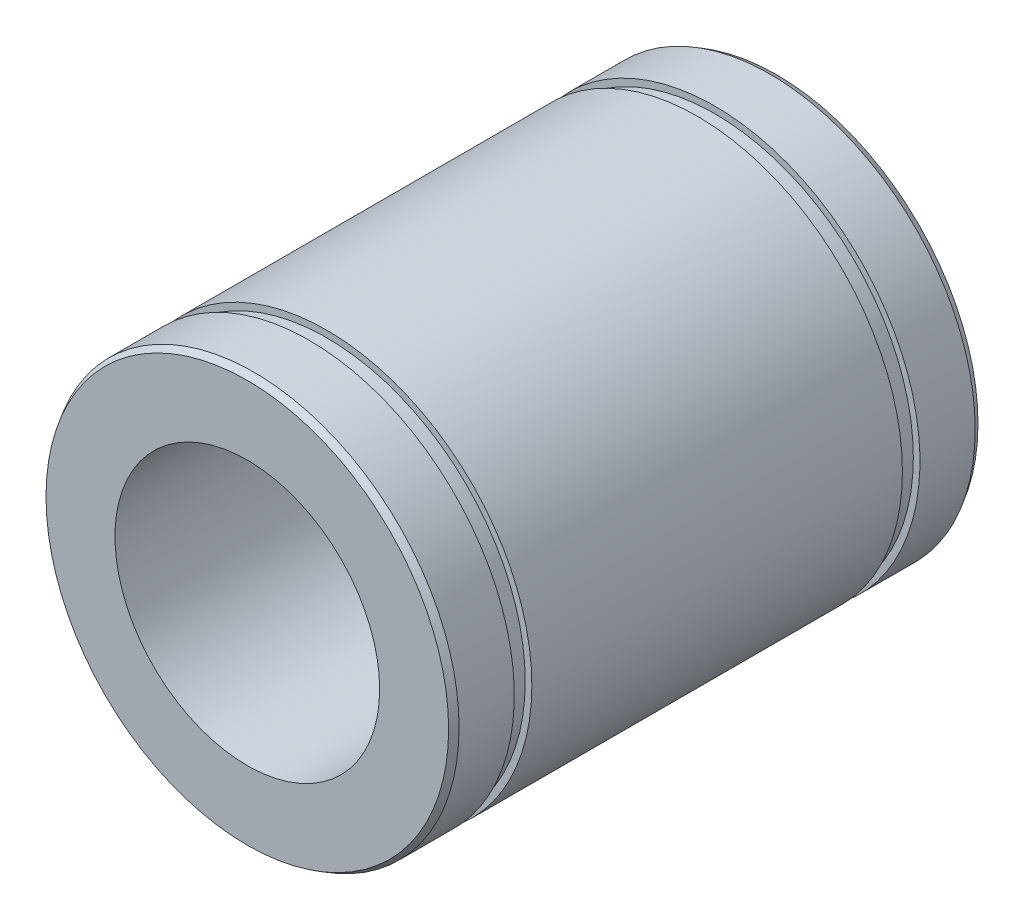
ISO-10303-21;
HEADER;
FILE_DESCRIPTION(('STEP AP214'),'2;1');
FILE_NAME('part.step','',(''),(''),'','','');
FILE_SCHEMA(('AUTOMOTIVE_DESIGN { 1 0 10303 214 1 1 1 1 }'));
ENDSEC;
DATA;
#1=APPLICATION_CONTEXT('core data for automotive mechanical design processes');
#2=APPLICATION_PROTOCOL_DEFINITION('international standard','automotive_design',2000,#1);
#3=PRODUCT_CONTEXT('',#1,'mechanical');
#4=PRODUCT('Part','Part','',(#3));
#5=PRODUCT_RELATED_PRODUCT_CATEGORY('part','',(#4));
#6=PRODUCT_DEFINITION_FORMATION('','',#4);
#7=PRODUCT_DEFINITION_CONTEXT('part definition',#1,'design');
#8=PRODUCT_DEFINITION('design','',#6,#7);
#9=PRODUCT_DEFINITION_SHAPE('','',#8);
#10=(LENGTH_UNIT() NAMED_UNIT(*) SI_UNIT(.MILLI.,.METRE.));
#11=(NAMED_UNIT(*) PLANE_ANGLE_UNIT() SI_UNIT($,.RADIAN.));
#12=(NAMED_UNIT(*) SI_UNIT($,.STERADIAN.) SOLID_ANGLE_UNIT());
#13=UNCERTAINTY_MEASURE_WITH_UNIT(LENGTH_MEASURE(1.E-05),#10,'distance_accuracy_value','');
#14=(GEOMETRIC_REPRESENTATION_CONTEXT(3) GLOBAL_UNCERTAINTY_ASSIGNED_CONTEXT((#13)) GLOBAL_UNIT_ASSIGNED_CONTEXT((#10,
#11,#12)) REPRESENTATION_CONTEXT('',''));
#15=CARTESIAN_POINT('',(0.,0.,0.));
#16=DIRECTION('',(0.,0.,1.));
#17=DIRECTION('',(1.,0.,0.));
#18=AXIS2_PLACEMENT_3D('',#15,#16,#17);
#19=CARTESIAN_POINT('',(0.,0.,40.));
#20=DIRECTION('',(0.,0.,-1.));
#21=DIRECTION('',(-1.,0.,0.));
#22=AXIS2_PLACEMENT_3D('',#19,#20,#21);
#23=CYLINDRICAL_SURFACE('',#22,31.);
#24=CARTESIAN_POINT('',(0.,0.,39.));
#25=DIRECTION('',(0.,0.,1.));
#26=DIRECTION('',(1.,0.,0.));
#27=AXIS2_PLACEMENT_3D('',#24,#25,#26);
#28=CIRCLE('',#27,31.);
#29=CARTESIAN_POINT('',(31.,0.,39.));
#30=VERTEX_POINT('',#29);
#31=EDGE_CURVE('E10',#30,#30,#28,.F.);
#32=ORIENTED_EDGE('',*,*,#31,.T.);
#33=EDGE_LOOP('',(#32));
#34=FACE_BOUND('',#33,.T.);
#35=CARTESIAN_POINT('',(0.,0.,30.65));
#36=DIRECTION('',(0.,0.,-1.));
#37=DIRECTION('',(-1.,0.,0.));
#38=AXIS2_PLACEMENT_3D('',#35,#36,#37);
#39=CIRCLE('',#38,31.);
#40=CARTESIAN_POINT('',(-31.,0.,30.65));
#41=VERTEX_POINT('',#40);
#42=EDGE_CURVE('E32',#41,#41,#39,.T.);
#43=ORIENTED_EDGE('',*,*,#42,.F.);
#44=EDGE_LOOP('',(#43));
#45=FACE_BOUND('',#44,.T.);
#46=ADVANCED_FACE('F29',(#34,#45),#23,.T.);
#47=CARTESIAN_POINT('',(0.,0.,28.));
#48=DIRECTION('',(0.,0.,1.));
#49=DIRECTION('',(1.,0.,0.));
#50=AXIS2_PLACEMENT_3D('',#47,#48,#49);
#51=CIRCLE('',#50,31.);
#52=CARTESIAN_POINT('',(31.,0.,28.));
#53=VERTEX_POINT('',#52);
#54=EDGE_CURVE('E44',#53,#53,#51,.T.);
#55=ORIENTED_EDGE('',*,*,#54,.F.);
#56=EDGE_LOOP('',(#55));
#57=FACE_BOUND('',#56,.T.);
#58=CARTESIAN_POINT('',(0.,0.,-28.));
#59=DIRECTION('',(0.,0.,1.));
#60=DIRECTION('',(1.,0.,0.));
#61=AXIS2_PLACEMENT_3D('',#58,#59,#60);
#62=CIRCLE('',#61,31.);
#63=CARTESIAN_POINT('',(31.,0.,-28.));
#64=VERTEX_POINT('',#63);
#65=EDGE_CURVE('E137',#64,#64,#62,.T.);
#66=ORIENTED_EDGE('',*,*,#65,.T.);
#67=EDGE_LOOP('',(#66));
#68=FACE_BOUND('',#67,.T.);
#69=ADVANCED_FACE('F67',(#57,#68),#23,.T.);
#70=CARTESIAN_POINT('',(0.,0.,40.));
#71=DIRECTION('',(0.,0.,1.));
#72=DIRECTION('',(1.,0.,0.));
#73=AXIS2_PLACEMENT_3D('',#70,#71,#72);
#74=PLANE('',#73);
#75=CARTESIAN_POINT('',(0.,0.,40.));
#76=DIRECTION('',(0.,0.,1.));
#77=DIRECTION('',(1.,0.,0.));
#78=AXIS2_PLACEMENT_3D('',#75,#76,#77);
#79=CIRCLE('',#78,30.4226497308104);
#80=CARTESIAN_POINT('',(30.4226497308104,0.,40.));
#81=VERTEX_POINT('',#80);
#82=EDGE_CURVE('E36',#81,#81,#79,.T.);
#83=ORIENTED_EDGE('',*,*,#82,.T.);
#84=EDGE_LOOP('',(#83));
#85=FACE_BOUND('',#84,.T.);
#86=CARTESIAN_POINT('',(0.,0.,40.));
#87=DIRECTION('',(0.,0.,1.));
#88=DIRECTION('',(1.,0.,0.));
#89=AXIS2_PLACEMENT_3D('',#86,#87,#88);
#90=CIRCLE('',#89,20.);
#91=CARTESIAN_POINT('',(20.,0.,40.));
#92=VERTEX_POINT('',#91);
#93=EDGE_CURVE('E41',#92,#92,#90,.T.);
#94=ORIENTED_EDGE('',*,*,#93,.F.);
#95=EDGE_LOOP('',(#94));
#96=FACE_BOUND('',#95,.T.);
#97=ADVANCED_FACE('F65',(#85,#96),#74,.T.);
#98=CARTESIAN_POINT('',(0.,0.,40.));
#99=DIRECTION('',(0.,0.,-1.));
#100=DIRECTION('',(-1.,0.,0.));
#101=AXIS2_PLACEMENT_3D('',#98,#99,#100);
#102=CYLINDRICAL_SURFACE('',#101,20.);
#103=ORIENTED_EDGE('',*,*,#93,.T.);
#104=EDGE_LOOP('',(#103));
#105=FACE_BOUND('',#104,.T.);
#106=CARTESIAN_POINT('',(0.,0.,-40.));
#107=DIRECTION('',(0.,0.,1.));
#108=DIRECTION('',(1.,0.,0.));
#109=AXIS2_PLACEMENT_3D('',#106,#107,#108);
#110=CIRCLE('',#109,20.);
#111=CARTESIAN_POINT('',(20.,0.,-40.));
#112=VERTEX_POINT('',#111);
#113=EDGE_CURVE('E140',#112,#112,#110,.T.);
#114=ORIENTED_EDGE('',*,*,#113,.F.);
#115=EDGE_LOOP('',(#114));
#116=FACE_BOUND('',#115,.T.);
#117=ADVANCED_FACE('F62',(#105,#116),#102,.F.);
#118=CARTESIAN_POINT('',(0.,0.,40.));
#119=DIRECTION('',(0.,0.,-1.));
#120=DIRECTION('',(-1.,0.,0.));
#121=AXIS2_PLACEMENT_3D('',#118,#119,#120);
#122=CONICAL_SURFACE('',#121,30.4226497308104,0.523598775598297);
#123=ORIENTED_EDGE('',*,*,#31,.F.);
#124=EDGE_LOOP('',(#123));
#125=FACE_BOUND('',#124,.T.);
#126=ORIENTED_EDGE('',*,*,#82,.F.);
#127=EDGE_LOOP('',(#126));
#128=FACE_BOUND('',#127,.T.);
#129=ADVANCED_FACE('F75',(#125,#128),#122,.T.);
#130=CARTESIAN_POINT('',(0.,30.,30.65));
#131=DIRECTION('',(0.,0.,-1.));
#132=DIRECTION('',(-1.,0.,0.));
#133=AXIS2_PLACEMENT_3D('',#130,#131,#132);
#134=PLANE('',#133);
#135=CARTESIAN_POINT('',(0.,0.,30.65));
#136=DIRECTION('',(0.,0.,1.));
#137=DIRECTION('',(1.,0.,0.));
#138=AXIS2_PLACEMENT_3D('',#135,#136,#137);
#139=CIRCLE('',#138,30.);
#140=CARTESIAN_POINT('',(30.,0.,30.65));
#141=VERTEX_POINT('',#140);
#142=EDGE_CURVE('E51',#141,#141,#139,.T.);
#143=ORIENTED_EDGE('',*,*,#142,.T.);
#144=EDGE_LOOP('',(#143));
#145=FACE_BOUND('',#144,.T.);
#146=ORIENTED_EDGE('',*,*,#42,.T.);
#147=EDGE_LOOP('',(#146));
#148=FACE_BOUND('',#147,.T.);
#149=ADVANCED_FACE('F88',(#145,#148),#134,.T.);
#150=CARTESIAN_POINT('',(0.,30.,28.));
#151=DIRECTION('',(0.,0.,1.));
#152=DIRECTION('',(1.,0.,0.));
#153=AXIS2_PLACEMENT_3D('',#150,#151,#152);
#154=PLANE('',#153);
#155=CARTESIAN_POINT('',(0.,0.,28.));
#156=DIRECTION('',(0.,0.,1.));
#157=DIRECTION('',(1.,0.,0.));
#158=AXIS2_PLACEMENT_3D('',#155,#156,#157);
#159=CIRCLE('',#158,30.);
#160=CARTESIAN_POINT('',(30.,0.,28.));
#161=VERTEX_POINT('',#160);
#162=EDGE_CURVE('E46',#161,#161,#159,.T.);
#163=ORIENTED_EDGE('',*,*,#162,.F.);
#164=EDGE_LOOP('',(#163));
#165=FACE_BOUND('',#164,.T.);
#166=ORIENTED_EDGE('',*,*,#54,.T.);
#167=EDGE_LOOP('',(#166));
#168=FACE_BOUND('',#167,.T.);
#169=ADVANCED_FACE('F90',(#165,#168),#154,.T.);
#170=CARTESIAN_POINT('',(0.,0.,39.));
#171=DIRECTION('',(0.,0.,1.));
#172=DIRECTION('',(1.,0.,0.));
#173=AXIS2_PLACEMENT_3D('',#170,#171,#172);
#174=CYLINDRICAL_SURFACE('',#173,30.);
#175=ORIENTED_EDGE('',*,*,#162,.T.);
#176=EDGE_LOOP('',(#175));
#177=FACE_BOUND('',#176,.T.);
#178=ORIENTED_EDGE('',*,*,#142,.F.);
#179=EDGE_LOOP('',(#178));
#180=FACE_BOUND('',#179,.T.);
#181=ADVANCED_FACE('F97',(#177,#180),#174,.T.);
#182=CARTESIAN_POINT('',(0.,0.,-40.));
#183=DIRECTION('',(0.,0.,1.));
#184=DIRECTION('',(-1.,0.,0.));
#185=AXIS2_PLACEMENT_3D('',#182,#183,#184);
#186=CYLINDRICAL_SURFACE('',#185,31.);
#187=CARTESIAN_POINT('',(0.,0.,-39.));
#188=DIRECTION('',(0.,0.,1.));
#189=DIRECTION('',(1.,0.,0.));
#190=AXIS2_PLACEMENT_3D('',#187,#188,#189);
#191=CIRCLE('',#190,31.);
#192=CARTESIAN_POINT('',(31.,0.,-39.));
#193=VERTEX_POINT('',#192);
#194=EDGE_CURVE('E56',#193,#193,#191,.F.);
#195=ORIENTED_EDGE('',*,*,#194,.F.);
#196=EDGE_LOOP('',(#195));
#197=FACE_BOUND('',#196,.T.);
#198=CARTESIAN_POINT('',(0.,0.,-30.65));
#199=DIRECTION('',(0.,0.,-1.));
#200=DIRECTION('',(-1.,0.,0.));
#201=AXIS2_PLACEMENT_3D('',#198,#199,#200);
#202=CIRCLE('',#201,31.);
#203=CARTESIAN_POINT('',(-31.,0.,-30.65));
#204=VERTEX_POINT('',#203);
#205=EDGE_CURVE('E144',#204,#204,#202,.T.);
#206=ORIENTED_EDGE('',*,*,#205,.T.);
#207=EDGE_LOOP('',(#206));
#208=FACE_BOUND('',#207,.T.);
#209=ADVANCED_FACE('F104',(#197,#208),#186,.T.);
#210=CARTESIAN_POINT('',(0.,0.,-40.));
#211=DIRECTION('',(0.,0.,-1.));
#212=DIRECTION('',(1.,0.,0.));
#213=AXIS2_PLACEMENT_3D('',#210,#211,#212);
#214=PLANE('',#213);
#215=CARTESIAN_POINT('',(0.,0.,-40.));
#216=DIRECTION('',(0.,0.,1.));
#217=DIRECTION('',(1.,0.,0.));
#218=AXIS2_PLACEMENT_3D('',#215,#216,#217);
#219=CIRCLE('',#218,30.4226497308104);
#220=CARTESIAN_POINT('',(30.4226497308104,0.,-40.));
#221=VERTEX_POINT('',#220);
#222=EDGE_CURVE('E143',#221,#221,#219,.T.);
#223=ORIENTED_EDGE('',*,*,#222,.F.);
#224=EDGE_LOOP('',(#223));
#225=FACE_BOUND('',#224,.T.);
#226=ORIENTED_EDGE('',*,*,#113,.T.);
#227=EDGE_LOOP('',(#226));
#228=FACE_BOUND('',#227,.T.);
#229=ADVANCED_FACE('F107',(#225,#228),#214,.T.);
#230=CARTESIAN_POINT('',(0.,0.,-40.));
#231=DIRECTION('',(0.,0.,1.));
#232=DIRECTION('',(-1.,0.,0.));
#233=AXIS2_PLACEMENT_3D('',#230,#231,#232);
#234=CONICAL_SURFACE('',#233,30.4226497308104,0.523598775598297);
#235=ORIENTED_EDGE('',*,*,#194,.T.);
#236=EDGE_LOOP('',(#235));
#237=FACE_BOUND('',#236,.T.);
#238=ORIENTED_EDGE('',*,*,#222,.T.);
#239=EDGE_LOOP('',(#238));
#240=FACE_BOUND('',#239,.T.);
#241=ADVANCED_FACE('F111',(#237,#240),#234,.T.);
#242=CARTESIAN_POINT('',(0.,30.,-30.65));
#243=DIRECTION('',(0.,0.,1.));
#244=DIRECTION('',(-1.,0.,0.));
#245=AXIS2_PLACEMENT_3D('',#242,#243,#244);
#246=PLANE('',#245);
#247=CARTESIAN_POINT('',(0.,0.,-30.65));
#248=DIRECTION('',(0.,0.,1.));
#249=DIRECTION('',(1.,0.,0.));
#250=AXIS2_PLACEMENT_3D('',#247,#248,#249);
#251=CIRCLE('',#250,30.);
#252=CARTESIAN_POINT('',(30.,0.,-30.65));
#253=VERTEX_POINT('',#252);
#254=EDGE_CURVE('E135',#253,#253,#251,.T.);
#255=ORIENTED_EDGE('',*,*,#254,.F.);
#256=EDGE_LOOP('',(#255));
#257=FACE_BOUND('',#256,.T.);
#258=ORIENTED_EDGE('',*,*,#205,.F.);
#259=EDGE_LOOP('',(#258));
#260=FACE_BOUND('',#259,.T.);
#261=ADVANCED_FACE('F115',(#257,#260),#246,.T.);
#262=CARTESIAN_POINT('',(0.,30.,-28.));
#263=DIRECTION('',(0.,0.,-1.));
#264=DIRECTION('',(1.,0.,0.));
#265=AXIS2_PLACEMENT_3D('',#262,#263,#264);
#266=PLANE('',#265);
#267=CARTESIAN_POINT('',(0.,0.,-28.));
#268=DIRECTION('',(0.,0.,1.));
#269=DIRECTION('',(1.,0.,0.));
#270=AXIS2_PLACEMENT_3D('',#267,#268,#269);
#271=CIRCLE('',#270,30.);
#272=CARTESIAN_POINT('',(30.,0.,-28.));
#273=VERTEX_POINT('',#272);
#274=EDGE_CURVE('E132',#273,#273,#271,.T.);
#275=ORIENTED_EDGE('',*,*,#274,.T.);
#276=EDGE_LOOP('',(#275));
#277=FACE_BOUND('',#276,.T.);
#278=ORIENTED_EDGE('',*,*,#65,.F.);
#279=EDGE_LOOP('',(#278));
#280=FACE_BOUND('',#279,.T.);
#281=ADVANCED_FACE('F119',(#277,#280),#266,.T.);
#282=CARTESIAN_POINT('',(0.,0.,-39.));
#283=DIRECTION('',(0.,0.,-1.));
#284=DIRECTION('',(1.,0.,0.));
#285=AXIS2_PLACEMENT_3D('',#282,#283,#284);
#286=CYLINDRICAL_SURFACE('',#285,30.);
#287=ORIENTED_EDGE('',*,*,#274,.F.);
#288=EDGE_LOOP('',(#287));
#289=FACE_BOUND('',#288,.T.);
#290=ORIENTED_EDGE('',*,*,#254,.T.);
#291=EDGE_LOOP('',(#290));
#292=FACE_BOUND('',#291,.T.);
#293=ADVANCED_FACE('F123',(#289,#292),#286,.T.);
#294=CLOSED_SHELL('',(#46,#69,#97,#117,#129,#149,#169,#181,#209,#229,#241,#261,#281,#293));
#295=MANIFOLD_SOLID_BREP('B2',#294);
#296=ADVANCED_BREP_SHAPE_REPRESENTATION('',(#18,#295),#14);
#297=SHAPE_DEFINITION_REPRESENTATION(#9,#296);
ENDSEC;
END-ISO-10303-21;
